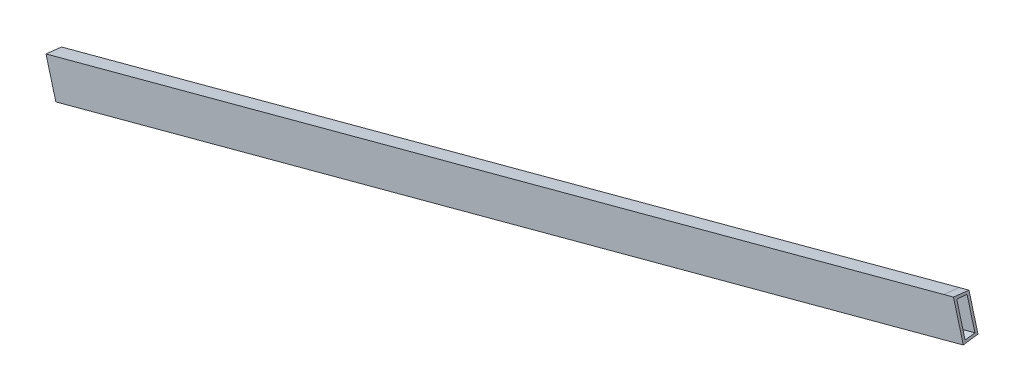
from build123d import *

# Parameters (mm, degrees)
BOSS_EXTRUDE1_DEPTH     = 25.4
SKETCH4_W               = 23.997073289
SKETCH4_H               = 20.386656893
CUT_EXTRUDE1_DEPTH      = 309.343960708
CUT_EXTRUDE2_DEPTH      = 325.919905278
CUT_EXTRUDE2_DEPTH_BACK = 325.919905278
BOSS_EXTRUDE3_DEPTH     = 3.175


with BuildPart() as part:
    # Sketch1 → Boss-Extrude1 (new body)
    with BuildSketch(Plane(origin=(0, 0, 0), x_dir=(0, 0, -1), z_dir=(1, 0, 0))):
        with BuildLine():
            Line((64.29375, 17.938061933), (64.29375, 7.373467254))
            add(Edge.make_bspline(
                [(64.29375, 7.373467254), (65.351478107, 7.504041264), (66.409826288, 7.629695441), (67.46875, 7.75018981)],
                knots=[0.728361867, 0.728361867, 0.728361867, 0.728361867, 0.738787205, 0.738787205, 0.738787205, 0.738787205], degree=3))
            Line((67.46875, 7.75018981), (67.46875, 17.629812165))
            add(Edge.make_bspline(
                [(67.46875, 17.629812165), (66.410784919, 17.736286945), (65.352462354, 17.839293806), (64.29375, 17.938061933)],
                knots=[1.266200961, 1.266200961, 1.266200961, 1.266200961, 1.276645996, 1.276645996, 1.276645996, 1.276645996], degree=3))
        make_face()
        with BuildLine():
            Line((65.09385, 17.058887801), (65.09385, 8.277208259))
            add(Edge.make_bspline(
                [(65.09385, 8.277208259), (65.618635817, 8.340583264), (66.143570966, 8.40273425), (66.66865, 8.463632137)],
                knots=[0.731305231, 0.731305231, 0.731305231, 0.731305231, 0.736463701, 0.736463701, 0.736463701, 0.736463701], degree=3))
            Line((66.66865, 8.463632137), (66.66865, 16.905642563))
            add(Edge.make_bspline(
                [(66.66865, 16.905642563), (66.143807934, 16.957653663), (65.61887595, 17.008766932), (65.09385, 17.058887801)],
                knots=[1.268574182, 1.268574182, 1.268574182, 1.268574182, 1.273764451, 1.273764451, 1.273764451, 1.273764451], degree=3))
        make_face(mode=Mode.SUBTRACT)
    extrude(amount=BOSS_EXTRUDE1_DEPTH)

    # Sketch4 → Cut-Extrude1 (cut, through all)
    with BuildSketch(Plane.ZY.offset(-25.4)):
        with Locations((-67.866331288, 12.028738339)):
            Rectangle(SKETCH4_W, SKETCH4_H)
    extrude(amount=CUT_EXTRUDE1_DEPTH, mode=Mode.SUBTRACT)


with BuildPart() as body_2:
    # Sweep1: sweep along a path in Sketch2
    with BuildLine(Plane.XY.offset(-64.29375)) as sweep1_path:
        Line((25.4, 7.373467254), (310.61406, 83.796344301))
    # Sketch3 → Sweep1 (sweep)
    with BuildSketch(Plane(origin=(25.4, 0, 0), x_dir=(0, 0, -1), z_dir=(1, 0, 0))):
        with BuildLine():
            Line((63.5, 18.809308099), (63.5, 6.475705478))
            add(Edge.make_bspline(
                [(63.5, 6.475705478), (65.086625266, 6.671570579), (66.67408129, 6.860892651), (68.2625, 7.041637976)],
                knots=[0.725434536, 0.725434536, 0.725434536, 0.725434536, 0.74109758, 0.74109758, 0.74109758, 0.74109758], degree=3))
            Line((68.2625, 7.041637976), (68.2625, 18.347687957))
            add(Edge.make_bspline(
                [(68.2625, 18.347687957), (66.67557654, 18.507397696), (65.088044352, 18.661158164), (63.5, 18.809308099)],
                knots=[1.263850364, 1.263850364, 1.263850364, 1.263850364, 1.279498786, 1.279498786, 1.279498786, 1.279498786], degree=3))
        make_face()
        with BuildLine():
            Line((64.29375, 17.938061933), (64.29375, 7.373467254))
            add(Edge.make_bspline(
                [(64.29375, 7.373467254), (65.351478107, 7.504041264), (66.409826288, 7.629695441), (67.46875, 7.75018981)],
                knots=[0.728361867, 0.728361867, 0.728361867, 0.728361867, 0.738787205, 0.738787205, 0.738787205, 0.738787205], degree=3))
            Line((67.46875, 7.75018981), (67.46875, 17.629812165))
            add(Edge.make_bspline(
                [(67.46875, 17.629812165), (66.410784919, 17.736286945), (65.352462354, 17.839293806), (64.29375, 17.938061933)],
                knots=[1.266200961, 1.266200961, 1.266200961, 1.266200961, 1.276645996, 1.276645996, 1.276645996, 1.276645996], degree=3))
        make_face(mode=Mode.SUBTRACT)
    sweep(path=sweep1_path.line)

    # Sketch5 → Cut-Extrude2 (cut, two sides: drawn at the far end of the back side and taken through both)
    with BuildSketch(Plane.XY.offset(-63.5).offset(-CUT_EXTRUDE2_DEPTH_BACK)):
        Polygon((25.4, 18.809308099), (28.483400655, 7.301900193), (25.4, 6.475705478), align=None)
        Polygon((310.61406, 95.232185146), (310.61406, 82.898582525), (307.530659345, 94.40599043), align=None)
    extrude(amount=CUT_EXTRUDE2_DEPTH + CUT_EXTRUDE2_DEPTH_BACK, mode=Mode.SUBTRACT)

    # Sketch7 → Boss-Extrude3 (add)
    with BuildSketch(Plane(origin=(310.531508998, 83.20666706, 0), x_dir=(0, 0, -1), z_dir=(0.9659258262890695, 0.2588190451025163, 0))):
        with BuildLine():
            Line((63.5, 11.594392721), (63.5, -0.318952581))
            add(Edge.make_bspline(
                [(63.5, -0.318952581), (63.89686515, -0.27162989), (64.293777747, -0.22470316), (64.690740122, -0.178203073), (65.087702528, -0.131702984), (65.484715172, -0.085629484), (65.88178012, -0.040013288), (66.675136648, 0.051130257), (67.468705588, 0.140448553), (68.2625, 0.227696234)],
                knots=[0, 0, 0, 0, 0.00119903, 0.00119903, 0.00119903, 0.00239806, 0.00239806, 0.00239806, 0.00479379, 0.00479379, 0.00479379, 0.00479379], degree=3))
            Line((68.2625, 0.227696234), (68.2625, 11.148501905))
            add(Edge.make_bspline(
                [(68.2625, 11.148501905), (67.865630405, 11.187082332), (67.468725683, 11.225303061), (67.071787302, 11.263169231), (66.674848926, 11.301035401), (66.277876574, 11.338547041), (65.880871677, 11.375709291), (65.087375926, 11.449985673), (64.293748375, 11.52286647), (63.5, 11.594392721)],
                knots=[0, 0, 0, 0, 0.001196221, 0.001196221, 0.001196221, 0.002392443, 0.002392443, 0.002392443, 0.004783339, 0.004783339, 0.004783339, 0.004783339], degree=3))
        make_face()
        with BuildLine():
            Line((64.29375, 0.548218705), (64.29375, 10.752833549))
            add(Edge.make_bspline(
                [(64.29375, 10.752833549), (64.558508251, 10.728975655), (64.823243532, 10.704861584), (65.087956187, 10.680502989), (65.352668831, 10.656144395), (65.617359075, 10.631541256), (65.882027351, 10.606705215), (66.411020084, 10.557065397), (66.939926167, 10.506495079), (67.46875, 10.455087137)],
                knots=[0, 0, 0, 0, 0.000797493, 0.000797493, 0.000797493, 0.001594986, 0.001594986, 0.001594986, 0.003188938, 0.003188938, 0.003188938, 0.003188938], degree=3))
            Line((67.46875, 10.455087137), (67.46875, 0.912104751))
            add(Edge.make_bspline(
                [(67.46875, 0.912104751), (67.20389947, 0.882994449), (66.939083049, 0.853572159), (66.67430144, 0.823841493), (66.409519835, 0.794110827), (66.144772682, 0.764071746), (65.880060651, 0.733727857), (65.351150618, 0.673099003), (64.822378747, 0.61125305), (64.29375, 0.548218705)],
                knots=[0, 0, 0, 0, 0.000799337, 0.000799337, 0.000799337, 0.001598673, 0.001598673, 0.001598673, 0.003195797, 0.003195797, 0.003195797, 0.003195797], degree=3))
        make_face(mode=Mode.SUBTRACT)
    extrude(amount=BOSS_EXTRUDE3_DEPTH)


solid = body_2.part
